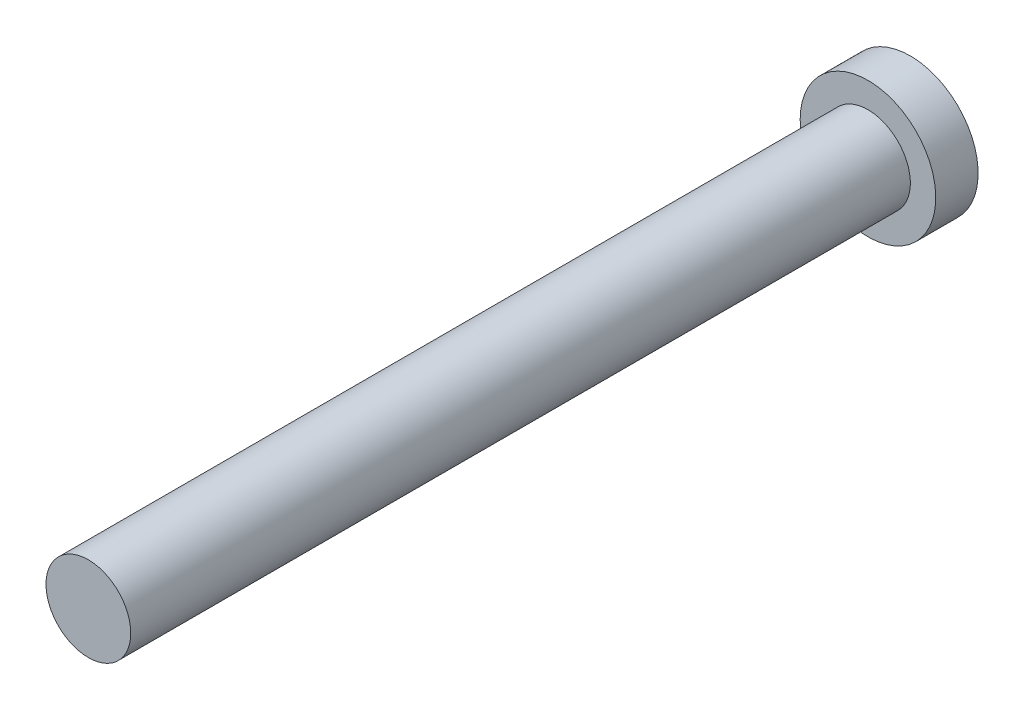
from build123d import *

# Parameters (mm, degrees)
ESQUISSE1_R      = 5
EXTRUSION1_DEPTH = 92
ESQUISSE2_R      = 8
EXTRUSION2_DEPTH = 5


with BuildPart() as part:
    # Esquisse1 → Extrusion1 (new body)
    with BuildSketch(Plane.XY):
        Circle(ESQUISSE1_R)
    extrude(amount=EXTRUSION1_DEPTH)

    # Esquisse2 → Extrusion2 (add)
    with BuildSketch(Plane(origin=(0, 0, 0), x_dir=(-1, 0, 0), z_dir=(0, 0, -1))):
        Circle(ESQUISSE2_R)
    extrude(amount=EXTRUSION2_DEPTH)


solid = part.part
